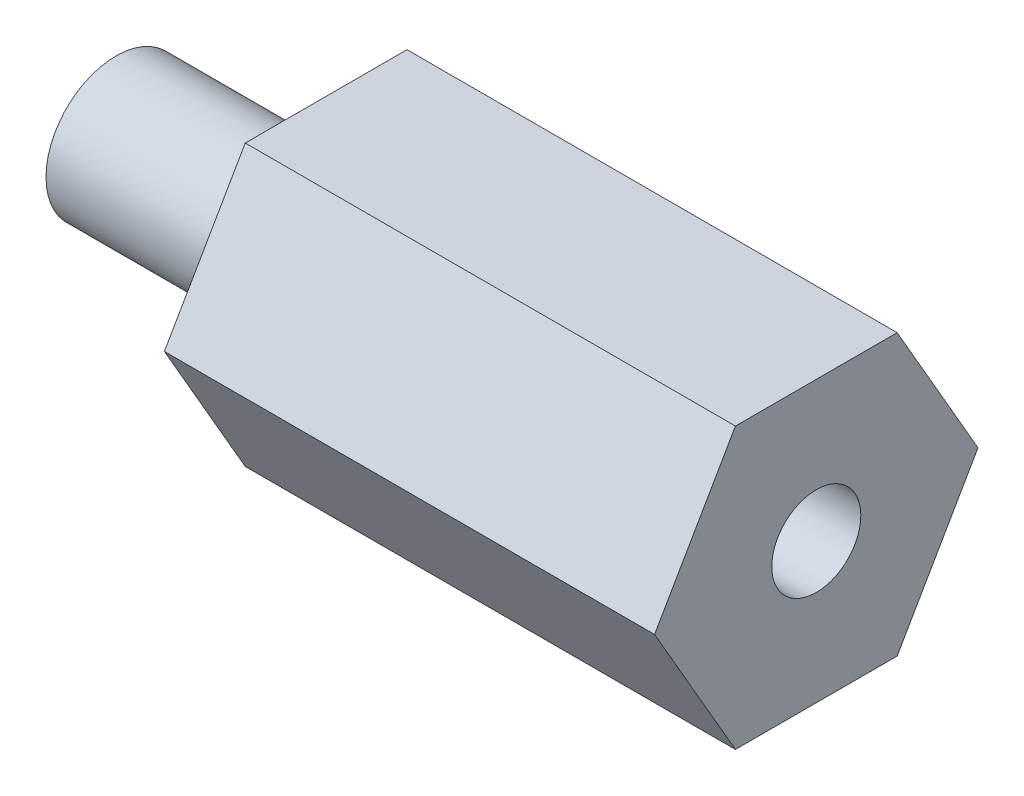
ISO-10303-21;
HEADER;
FILE_DESCRIPTION(('STEP AP214'),'2;1');
FILE_NAME('part.step','',(''),(''),'','','');
FILE_SCHEMA(('AUTOMOTIVE_DESIGN { 1 0 10303 214 1 1 1 1 }'));
ENDSEC;
DATA;
#1=APPLICATION_CONTEXT('core data for automotive mechanical design processes');
#2=APPLICATION_PROTOCOL_DEFINITION('international standard','automotive_design',2000,#1);
#3=PRODUCT_CONTEXT('',#1,'mechanical');
#4=PRODUCT('Part','Part','',(#3));
#5=PRODUCT_RELATED_PRODUCT_CATEGORY('part','',(#4));
#6=PRODUCT_DEFINITION_FORMATION('','',#4);
#7=PRODUCT_DEFINITION_CONTEXT('part definition',#1,'design');
#8=PRODUCT_DEFINITION('design','',#6,#7);
#9=PRODUCT_DEFINITION_SHAPE('','',#8);
#10=(LENGTH_UNIT() NAMED_UNIT(*) SI_UNIT(.MILLI.,.METRE.));
#11=(NAMED_UNIT(*) PLANE_ANGLE_UNIT() SI_UNIT($,.RADIAN.));
#12=(NAMED_UNIT(*) SI_UNIT($,.STERADIAN.) SOLID_ANGLE_UNIT());
#13=UNCERTAINTY_MEASURE_WITH_UNIT(LENGTH_MEASURE(1.E-05),#10,'distance_accuracy_value','');
#14=(GEOMETRIC_REPRESENTATION_CONTEXT(3) GLOBAL_UNCERTAINTY_ASSIGNED_CONTEXT((#13)) GLOBAL_UNIT_ASSIGNED_CONTEXT((#10,
#11,#12)) REPRESENTATION_CONTEXT('',''));
#15=CARTESIAN_POINT('',(0.,0.,0.));
#16=DIRECTION('',(0.,0.,1.));
#17=DIRECTION('',(1.,0.,0.));
#18=AXIS2_PLACEMENT_3D('',#15,#16,#17);
#19=CARTESIAN_POINT('',(31.75,-6.34999999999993,-3.66617420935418));
#20=DIRECTION('',(0.,0.499999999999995,0.866025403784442));
#21=DIRECTION('',(0.,-0.866025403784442,0.499999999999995));
#22=AXIS2_PLACEMENT_3D('',#19,#20,#21);
#23=PLANE('',#22);
#24=DIRECTION('',(0.,-0.866025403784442,0.499999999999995));
#25=VECTOR('',#24,1.);
#26=CARTESIAN_POINT('',(9.525,-6.34999999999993,-3.66617420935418));
#27=LINE('',#26,#25);
#28=CARTESIAN_POINT('',(9.525,0.,-7.33234841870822));
#29=VERTEX_POINT('',#28);
#30=CARTESIAN_POINT('',(9.525,-6.34999999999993,-3.66617420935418));
#31=VERTEX_POINT('',#30);
#32=EDGE_CURVE('E51',#29,#31,#27,.T.);
#33=ORIENTED_EDGE('',*,*,#32,.F.);
#34=DIRECTION('',(-1.,0.,0.));
#35=VECTOR('',#34,1.);
#36=CARTESIAN_POINT('',(31.75,0.,-7.33234841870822));
#37=LINE('',#36,#35);
#38=CARTESIAN_POINT('',(31.75,0.,-7.33234841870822));
#39=VERTEX_POINT('',#38);
#40=EDGE_CURVE('E45',#39,#29,#37,.T.);
#41=ORIENTED_EDGE('',*,*,#40,.F.);
#42=DIRECTION('',(0.,0.866025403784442,-0.499999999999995));
#43=VECTOR('',#42,1.);
#44=CARTESIAN_POINT('',(31.75,-6.34999999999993,-3.66617420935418));
#45=LINE('',#44,#43);
#46=CARTESIAN_POINT('',(31.75,-6.34999999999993,-3.66617420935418));
#47=VERTEX_POINT('',#46);
#48=EDGE_CURVE('E135',#47,#39,#45,.T.);
#49=ORIENTED_EDGE('',*,*,#48,.F.);
#50=DIRECTION('',(-1.,0.,0.));
#51=VECTOR('',#50,1.);
#52=CARTESIAN_POINT('',(31.75,-6.34999999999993,-3.66617420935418));
#53=LINE('',#52,#51);
#54=EDGE_CURVE('E119',#47,#31,#53,.T.);
#55=ORIENTED_EDGE('',*,*,#54,.T.);
#56=EDGE_LOOP('',(#33,#41,#49,#55));
#57=FACE_BOUND('',#56,.T.);
#58=ADVANCED_FACE('F38',(#57),#23,.F.);
#59=CARTESIAN_POINT('',(31.75,0.,-7.33234841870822));
#60=DIRECTION('',(0.,-0.500000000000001,0.866025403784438));
#61=DIRECTION('',(0.,-0.866025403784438,-0.500000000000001));
#62=AXIS2_PLACEMENT_3D('',#59,#60,#61);
#63=PLANE('',#62);
#64=DIRECTION('',(0.,-0.866025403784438,-0.500000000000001));
#65=VECTOR('',#64,1.);
#66=CARTESIAN_POINT('',(9.525,0.,-7.33234841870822));
#67=LINE('',#66,#65);
#68=CARTESIAN_POINT('',(9.525,6.34999999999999,-3.6661742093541));
#69=VERTEX_POINT('',#68);
#70=EDGE_CURVE('E130',#69,#29,#67,.T.);
#71=ORIENTED_EDGE('',*,*,#70,.F.);
#72=DIRECTION('',(-1.,0.,0.));
#73=VECTOR('',#72,1.);
#74=CARTESIAN_POINT('',(31.75,6.34999999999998,-3.6661742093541));
#75=LINE('',#74,#73);
#76=CARTESIAN_POINT('',(31.75,6.34999999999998,-3.6661742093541));
#77=VERTEX_POINT('',#76);
#78=EDGE_CURVE('E117',#77,#69,#75,.T.);
#79=ORIENTED_EDGE('',*,*,#78,.F.);
#80=DIRECTION('',(0.,0.866025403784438,0.500000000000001));
#81=VECTOR('',#80,1.);
#82=CARTESIAN_POINT('',(31.75,0.,-7.33234841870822));
#83=LINE('',#82,#81);
#84=EDGE_CURVE('E131',#39,#77,#83,.T.);
#85=ORIENTED_EDGE('',*,*,#84,.F.);
#86=ORIENTED_EDGE('',*,*,#40,.T.);
#87=EDGE_LOOP('',(#71,#79,#85,#86));
#88=FACE_BOUND('',#87,.T.);
#89=ADVANCED_FACE('F128',(#88),#63,.F.);
#90=CARTESIAN_POINT('',(31.75,6.34999999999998,-3.6661742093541));
#91=DIRECTION('',(0.,-1.,0.));
#92=DIRECTION('',(0.,0.,-1.));
#93=AXIS2_PLACEMENT_3D('',#90,#91,#92);
#94=PLANE('',#93);
#95=DIRECTION('',(0.,0.,-1.));
#96=VECTOR('',#95,1.);
#97=CARTESIAN_POINT('',(9.525,6.34999999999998,-3.6661742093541));
#98=LINE('',#97,#96);
#99=CARTESIAN_POINT('',(9.525,6.34999999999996,3.66617420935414));
#100=VERTEX_POINT('',#99);
#101=EDGE_CURVE('E111',#100,#69,#98,.T.);
#102=ORIENTED_EDGE('',*,*,#101,.F.);
#103=DIRECTION('',(-1.,0.,0.));
#104=VECTOR('',#103,1.);
#105=CARTESIAN_POINT('',(31.75,6.34999999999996,3.66617420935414));
#106=LINE('',#105,#104);
#107=CARTESIAN_POINT('',(31.75,6.34999999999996,3.66617420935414));
#108=VERTEX_POINT('',#107);
#109=EDGE_CURVE('E110',#108,#100,#106,.T.);
#110=ORIENTED_EDGE('',*,*,#109,.F.);
#111=DIRECTION('',(0.,0.,1.));
#112=VECTOR('',#111,1.);
#113=CARTESIAN_POINT('',(31.75,6.34999999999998,-3.6661742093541));
#114=LINE('',#113,#112);
#115=EDGE_CURVE('E148',#77,#108,#114,.T.);
#116=ORIENTED_EDGE('',*,*,#115,.F.);
#117=ORIENTED_EDGE('',*,*,#78,.T.);
#118=EDGE_LOOP('',(#102,#110,#116,#117));
#119=FACE_BOUND('',#118,.T.);
#120=ADVANCED_FACE('F171',(#119),#94,.F.);
#121=CARTESIAN_POINT('',(31.75,6.34999999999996,3.66617420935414));
#122=DIRECTION('',(0.,-0.499999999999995,-0.866025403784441));
#123=DIRECTION('',(0.,0.866025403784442,-0.499999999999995));
#124=AXIS2_PLACEMENT_3D('',#121,#122,#123);
#125=PLANE('',#124);
#126=DIRECTION('',(0.,0.866025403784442,-0.499999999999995));
#127=VECTOR('',#126,1.);
#128=CARTESIAN_POINT('',(9.525,6.34999999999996,3.66617420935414));
#129=LINE('',#128,#127);
#130=CARTESIAN_POINT('',(9.525,0.,7.33234841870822));
#131=VERTEX_POINT('',#130);
#132=EDGE_CURVE('E94',#131,#100,#129,.T.);
#133=ORIENTED_EDGE('',*,*,#132,.F.);
#134=DIRECTION('',(-1.,0.,0.));
#135=VECTOR('',#134,1.);
#136=CARTESIAN_POINT('',(31.75,0.,7.33234841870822));
#137=LINE('',#136,#135);
#138=CARTESIAN_POINT('',(31.75,0.,7.33234841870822));
#139=VERTEX_POINT('',#138);
#140=EDGE_CURVE('E107',#139,#131,#137,.T.);
#141=ORIENTED_EDGE('',*,*,#140,.F.);
#142=DIRECTION('',(0.,-0.866025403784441,0.499999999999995));
#143=VECTOR('',#142,1.);
#144=CARTESIAN_POINT('',(31.75,6.34999999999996,3.66617420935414));
#145=LINE('',#144,#143);
#146=EDGE_CURVE('E150',#108,#139,#145,.T.);
#147=ORIENTED_EDGE('',*,*,#146,.F.);
#148=ORIENTED_EDGE('',*,*,#109,.T.);
#149=EDGE_LOOP('',(#133,#141,#147,#148));
#150=FACE_BOUND('',#149,.T.);
#151=ADVANCED_FACE('F105',(#150),#125,.F.);
#152=CARTESIAN_POINT('',(31.75,0.,7.33234841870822));
#153=DIRECTION('',(0.,0.500000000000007,-0.866025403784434));
#154=DIRECTION('',(0.,0.866025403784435,0.500000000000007));
#155=AXIS2_PLACEMENT_3D('',#152,#153,#154);
#156=PLANE('',#155);
#157=DIRECTION('',(0.,0.866025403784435,0.500000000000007));
#158=VECTOR('',#157,1.);
#159=CARTESIAN_POINT('',(9.525,0.,7.33234841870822));
#160=LINE('',#159,#158);
#161=CARTESIAN_POINT('',(9.525,-6.35000000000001,3.66617420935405));
#162=VERTEX_POINT('',#161);
#163=EDGE_CURVE('E91',#162,#131,#160,.T.);
#164=ORIENTED_EDGE('',*,*,#163,.F.);
#165=DIRECTION('',(-1.,0.,0.));
#166=VECTOR('',#165,1.);
#167=CARTESIAN_POINT('',(31.75,-6.35000000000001,3.66617420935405));
#168=LINE('',#167,#166);
#169=CARTESIAN_POINT('',(31.75,-6.35000000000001,3.66617420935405));
#170=VERTEX_POINT('',#169);
#171=EDGE_CURVE('E115',#170,#162,#168,.T.);
#172=ORIENTED_EDGE('',*,*,#171,.F.);
#173=DIRECTION('',(0.,-0.866025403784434,-0.500000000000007));
#174=VECTOR('',#173,1.);
#175=CARTESIAN_POINT('',(31.75,0.,7.33234841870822));
#176=LINE('',#175,#174);
#177=EDGE_CURVE('E114',#139,#170,#176,.T.);
#178=ORIENTED_EDGE('',*,*,#177,.F.);
#179=ORIENTED_EDGE('',*,*,#140,.T.);
#180=EDGE_LOOP('',(#164,#172,#178,#179));
#181=FACE_BOUND('',#180,.T.);
#182=ADVANCED_FACE('F113',(#181),#156,.F.);
#183=CARTESIAN_POINT('',(31.75,-6.35000000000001,3.66617420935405));
#184=DIRECTION('',(0.,1.,0.));
#185=DIRECTION('',(0.,0.,1.));
#186=AXIS2_PLACEMENT_3D('',#183,#184,#185);
#187=PLANE('',#186);
#188=DIRECTION('',(0.,0.,1.));
#189=VECTOR('',#188,1.);
#190=CARTESIAN_POINT('',(9.525,-6.35000000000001,3.66617420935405));
#191=LINE('',#190,#189);
#192=EDGE_CURVE('E11',#31,#162,#191,.T.);
#193=ORIENTED_EDGE('',*,*,#192,.F.);
#194=ORIENTED_EDGE('',*,*,#54,.F.);
#195=DIRECTION('',(0.,0.,-1.));
#196=VECTOR('',#195,1.);
#197=CARTESIAN_POINT('',(31.75,-6.35000000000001,3.66617420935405));
#198=LINE('',#197,#196);
#199=EDGE_CURVE('E59',#170,#47,#198,.T.);
#200=ORIENTED_EDGE('',*,*,#199,.F.);
#201=ORIENTED_EDGE('',*,*,#171,.T.);
#202=EDGE_LOOP('',(#193,#194,#200,#201));
#203=FACE_BOUND('',#202,.T.);
#204=ADVANCED_FACE('F155',(#203),#187,.F.);
#205=CARTESIAN_POINT('',(31.75,0.,0.));
#206=DIRECTION('',(1.,0.,0.));
#207=DIRECTION('',(0.,0.,-1.));
#208=AXIS2_PLACEMENT_3D('',#205,#206,#207);
#209=PLANE('',#208);
#210=CARTESIAN_POINT('',(31.75,0.,0.));
#211=DIRECTION('',(1.,0.,0.));
#212=DIRECTION('',(0.,0.,-1.));
#213=AXIS2_PLACEMENT_3D('',#210,#211,#212);
#214=CIRCLE('',#213,2.01929999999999);
#215=CARTESIAN_POINT('',(31.75,0.,-2.01930000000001));
#216=VERTEX_POINT('',#215);
#217=EDGE_CURVE('E136',#216,#216,#214,.T.);
#218=ORIENTED_EDGE('',*,*,#217,.F.);
#219=EDGE_LOOP('',(#218));
#220=FACE_BOUND('',#219,.T.);
#221=ORIENTED_EDGE('',*,*,#48,.T.);
#222=ORIENTED_EDGE('',*,*,#84,.T.);
#223=ORIENTED_EDGE('',*,*,#115,.T.);
#224=ORIENTED_EDGE('',*,*,#146,.T.);
#225=ORIENTED_EDGE('',*,*,#177,.T.);
#226=ORIENTED_EDGE('',*,*,#199,.T.);
#227=EDGE_LOOP('',(#221,#222,#223,#224,#225,#226));
#228=FACE_BOUND('',#227,.T.);
#229=ADVANCED_FACE('F153',(#220,#228),#209,.T.);
#230=CARTESIAN_POINT('',(19.05,0.,0.));
#231=DIRECTION('',(1.,0.,0.));
#232=DIRECTION('',(0.,0.,-1.));
#233=AXIS2_PLACEMENT_3D('',#230,#231,#232);
#234=CONICAL_SURFACE('',#233,2.0193,1.02974425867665);
#235=CARTESIAN_POINT('',(17.8366821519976,0.,0.));
#236=VERTEX_POINT('',#235);
#237=VERTEX_LOOP('',#236);
#238=FACE_BOUND('',#237,.T.);
#239=CARTESIAN_POINT('',(19.05,0.,0.));
#240=DIRECTION('',(1.,0.,0.));
#241=DIRECTION('',(0.,0.,-1.));
#242=AXIS2_PLACEMENT_3D('',#239,#240,#241);
#243=CIRCLE('',#242,2.0193);
#244=CARTESIAN_POINT('',(19.05,0.,-2.01930000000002));
#245=VERTEX_POINT('',#244);
#246=EDGE_CURVE('E139',#245,#245,#243,.T.);
#247=ORIENTED_EDGE('',*,*,#246,.T.);
#248=EDGE_LOOP('',(#247));
#249=FACE_BOUND('',#248,.T.);
#250=ADVANCED_FACE('F162',(#238,#249),#234,.F.);
#251=CARTESIAN_POINT('',(31.75,0.,0.));
#252=DIRECTION('',(1.,0.,0.));
#253=DIRECTION('',(0.,0.,-1.));
#254=AXIS2_PLACEMENT_3D('',#251,#252,#253);
#255=CYLINDRICAL_SURFACE('',#254,2.01929999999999);
#256=ORIENTED_EDGE('',*,*,#246,.F.);
#257=EDGE_LOOP('',(#256));
#258=FACE_BOUND('',#257,.T.);
#259=ORIENTED_EDGE('',*,*,#217,.T.);
#260=EDGE_LOOP('',(#259));
#261=FACE_BOUND('',#260,.T.);
#262=ADVANCED_FACE('F202',(#258,#261),#255,.F.);
#263=CARTESIAN_POINT('',(9.525,0.,0.));
#264=DIRECTION('',(-1.,0.,0.));
#265=DIRECTION('',(0.,0.,1.));
#266=AXIS2_PLACEMENT_3D('',#263,#264,#265);
#267=PLANE('',#266);
#268=CARTESIAN_POINT('',(9.525,0.,0.));
#269=DIRECTION('',(-1.,0.,0.));
#270=DIRECTION('',(0.,0.,1.));
#271=AXIS2_PLACEMENT_3D('',#268,#269,#270);
#272=CIRCLE('',#271,3.175);
#273=CARTESIAN_POINT('',(9.525,0.,3.175));
#274=VERTEX_POINT('',#273);
#275=EDGE_CURVE('E100',#274,#274,#272,.T.);
#276=ORIENTED_EDGE('',*,*,#275,.F.);
#277=EDGE_LOOP('',(#276));
#278=FACE_BOUND('',#277,.T.);
#279=ORIENTED_EDGE('',*,*,#32,.T.);
#280=ORIENTED_EDGE('',*,*,#192,.T.);
#281=ORIENTED_EDGE('',*,*,#163,.T.);
#282=ORIENTED_EDGE('',*,*,#132,.T.);
#283=ORIENTED_EDGE('',*,*,#101,.T.);
#284=ORIENTED_EDGE('',*,*,#70,.T.);
#285=EDGE_LOOP('',(#279,#280,#281,#282,#283,#284));
#286=FACE_BOUND('',#285,.T.);
#287=ADVANCED_FACE('F93',(#278,#286),#267,.T.);
#288=CARTESIAN_POINT('',(9.525,0.,0.));
#289=DIRECTION('',(-1.,0.,0.));
#290=DIRECTION('',(0.,0.,1.));
#291=AXIS2_PLACEMENT_3D('',#288,#289,#290);
#292=CYLINDRICAL_SURFACE('',#291,3.175);
#293=CARTESIAN_POINT('',(0.,0.,0.));
#294=DIRECTION('',(-1.,0.,0.));
#295=DIRECTION('',(0.,0.,1.));
#296=AXIS2_PLACEMENT_3D('',#293,#294,#295);
#297=CIRCLE('',#296,3.175);
#298=CARTESIAN_POINT('',(0.,0.,3.175));
#299=VERTEX_POINT('',#298);
#300=EDGE_CURVE('E272',#299,#299,#297,.T.);
#301=CARTESIAN_POINT('',(9.525,0.,3.175));
#302=CARTESIAN_POINT('',(9.42578125,0.,3.175));
#303=CARTESIAN_POINT('',(9.3265625,0.,3.175));
#304=CARTESIAN_POINT('',(9.128125,0.,3.175));
#305=CARTESIAN_POINT('',(9.02890625,0.,3.175));
#306=CARTESIAN_POINT('',(8.83046875,0.,3.175));
#307=CARTESIAN_POINT('',(8.73125,0.,3.175));
#308=CARTESIAN_POINT('',(8.5328125,0.,3.175));
#309=CARTESIAN_POINT('',(8.43359375,0.,3.175));
#310=CARTESIAN_POINT('',(8.23515625,0.,3.175));
#311=CARTESIAN_POINT('',(8.1359375,0.,3.175));
#312=CARTESIAN_POINT('',(7.9375,0.,3.175));
#313=CARTESIAN_POINT('',(7.83828125,0.,3.175));
#314=CARTESIAN_POINT('',(7.63984375,0.,3.175));
#315=CARTESIAN_POINT('',(7.540625,0.,3.175));
#316=CARTESIAN_POINT('',(7.3421875,0.,3.175));
#317=CARTESIAN_POINT('',(7.24296875,0.,3.175));
#318=CARTESIAN_POINT('',(7.04453125,0.,3.175));
#319=CARTESIAN_POINT('',(6.9453125,0.,3.175));
#320=CARTESIAN_POINT('',(6.746875,0.,3.175));
#321=CARTESIAN_POINT('',(6.64765625,0.,3.175));
#322=CARTESIAN_POINT('',(6.44921875,0.,3.175));
#323=CARTESIAN_POINT('',(6.35,0.,3.175));
#324=CARTESIAN_POINT('',(6.1515625,0.,3.175));
#325=CARTESIAN_POINT('',(6.05234375,0.,3.175));
#326=CARTESIAN_POINT('',(5.85390625,0.,3.175));
#327=CARTESIAN_POINT('',(5.7546875,0.,3.175));
#328=CARTESIAN_POINT('',(5.55625,0.,3.175));
#329=CARTESIAN_POINT('',(5.45703125,0.,3.175));
#330=CARTESIAN_POINT('',(5.25859375,0.,3.175));
#331=CARTESIAN_POINT('',(5.159375,0.,3.175));
#332=CARTESIAN_POINT('',(4.9609375,0.,3.175));
#333=CARTESIAN_POINT('',(4.86171875,0.,3.175));
#334=CARTESIAN_POINT('',(4.66328125,0.,3.175));
#335=CARTESIAN_POINT('',(4.5640625,0.,3.175));
#336=CARTESIAN_POINT('',(4.365625,0.,3.175));
#337=CARTESIAN_POINT('',(4.26640625,0.,3.175));
#338=CARTESIAN_POINT('',(4.06796875,0.,3.175));
#339=CARTESIAN_POINT('',(3.96875,0.,3.175));
#340=CARTESIAN_POINT('',(3.7703125,0.,3.175));
#341=CARTESIAN_POINT('',(3.67109375,0.,3.175));
#342=CARTESIAN_POINT('',(3.47265625,0.,3.175));
#343=CARTESIAN_POINT('',(3.3734375,0.,3.175));
#344=CARTESIAN_POINT('',(3.175,0.,3.175));
#345=CARTESIAN_POINT('',(3.07578125,0.,3.175));
#346=CARTESIAN_POINT('',(2.87734375,0.,3.175));
#347=CARTESIAN_POINT('',(2.778125,0.,3.175));
#348=CARTESIAN_POINT('',(2.5796875,0.,3.175));
#349=CARTESIAN_POINT('',(2.48046875,0.,3.175));
#350=CARTESIAN_POINT('',(2.28203125,0.,3.175));
#351=CARTESIAN_POINT('',(2.1828125,0.,3.175));
#352=CARTESIAN_POINT('',(1.984375,0.,3.175));
#353=CARTESIAN_POINT('',(1.88515625,0.,3.175));
#354=CARTESIAN_POINT('',(1.68671875,0.,3.175));
#355=CARTESIAN_POINT('',(1.5875,0.,3.175));
#356=CARTESIAN_POINT('',(1.3890625,0.,3.175));
#357=CARTESIAN_POINT('',(1.28984375,0.,3.175));
#358=CARTESIAN_POINT('',(1.09140625,0.,3.175));
#359=CARTESIAN_POINT('',(0.992187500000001,0.,3.175));
#360=CARTESIAN_POINT('',(0.793750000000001,0.,3.175));
#361=CARTESIAN_POINT('',(0.69453125,0.,3.175));
#362=CARTESIAN_POINT('',(0.49609375,0.,3.175));
#363=CARTESIAN_POINT('',(0.396875,0.,3.175));
#364=CARTESIAN_POINT('',(0.1984375,0.,3.175));
#365=CARTESIAN_POINT('',(0.0992187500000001,0.,3.175));
#366=CARTESIAN_POINT('',(0.,0.,3.175));
#367=B_SPLINE_CURVE_WITH_KNOTS('',3,(#301,#302,#303,#304,#305,#306,#307,#308,#309,#310,#311,
#312,#313,#314,#315,#316,#317,#318,#319,#320,#321,#322,#323,#324,#325,#326,#327,#328,#329,#330,
#331,#332,#333,#334,#335,#336,#337,#338,#339,#340,#341,#342,#343,#344,#345,#346,#347,#348,#349,
#350,#351,#352,#353,#354,#355,#356,#357,#358,#359,#360,#361,#362,#363,#364,#365,#366),
.UNSPECIFIED.,.F.,.F.,(4,2,2,2,2,2,2,2,2,2,2,2,2,2,2,2,2,2,2,2,2,2,2,2,2,2,2,2,2,2,2,2,4),(0.,
0.297656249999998,0.595312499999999,0.892968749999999,1.190625,1.48828125,1.7859375,2.08359375,
2.38125,2.67890625,2.9765625,3.27421875,3.571875,3.86953125,4.1671875,4.46484375,4.7625,
5.06015625,5.3578125,5.65546875,5.953125,6.25078125,6.5484375,6.84609375,7.14375,7.44140625,
7.7390625,8.03671875,8.334375,8.63203125,8.9296875,9.22734375,9.525),.UNSPECIFIED.);
#368=EDGE_CURVE('BSEAM201',#274,#299,#367,.T.);
#369=ORIENTED_EDGE('',*,*,#275,.T.);
#370=ORIENTED_EDGE('',*,*,#300,.F.);
#371=ORIENTED_EDGE('',*,*,#368,.T.);
#372=ORIENTED_EDGE('',*,*,#368,.F.);
#373=EDGE_LOOP('',(#369,#371,#370,#372));
#374=FACE_BOUND('',#373,.T.);
#375=ADVANCED_FACE('F201',(#374),#292,.T.);
#376=CARTESIAN_POINT('',(0.,0.,0.));
#377=DIRECTION('',(1.,0.,0.));
#378=DIRECTION('',(0.,0.,-1.));
#379=AXIS2_PLACEMENT_3D('',#376,#377,#378);
#380=PLANE('',#379);
#381=ORIENTED_EDGE('',*,*,#300,.T.);
#382=EDGE_LOOP('',(#381));
#383=FACE_BOUND('',#382,.T.);
#384=ADVANCED_FACE('F214',(#383),#380,.F.);
#385=CLOSED_SHELL('',(#58,#89,#120,#151,#182,#204,#229,#250,#262,#287,#375,#384));
#386=MANIFOLD_SOLID_BREP('B2',#385);
#387=ADVANCED_BREP_SHAPE_REPRESENTATION('',(#18,#386),#14);
#388=SHAPE_DEFINITION_REPRESENTATION(#9,#387);
ENDSEC;
END-ISO-10303-21;
